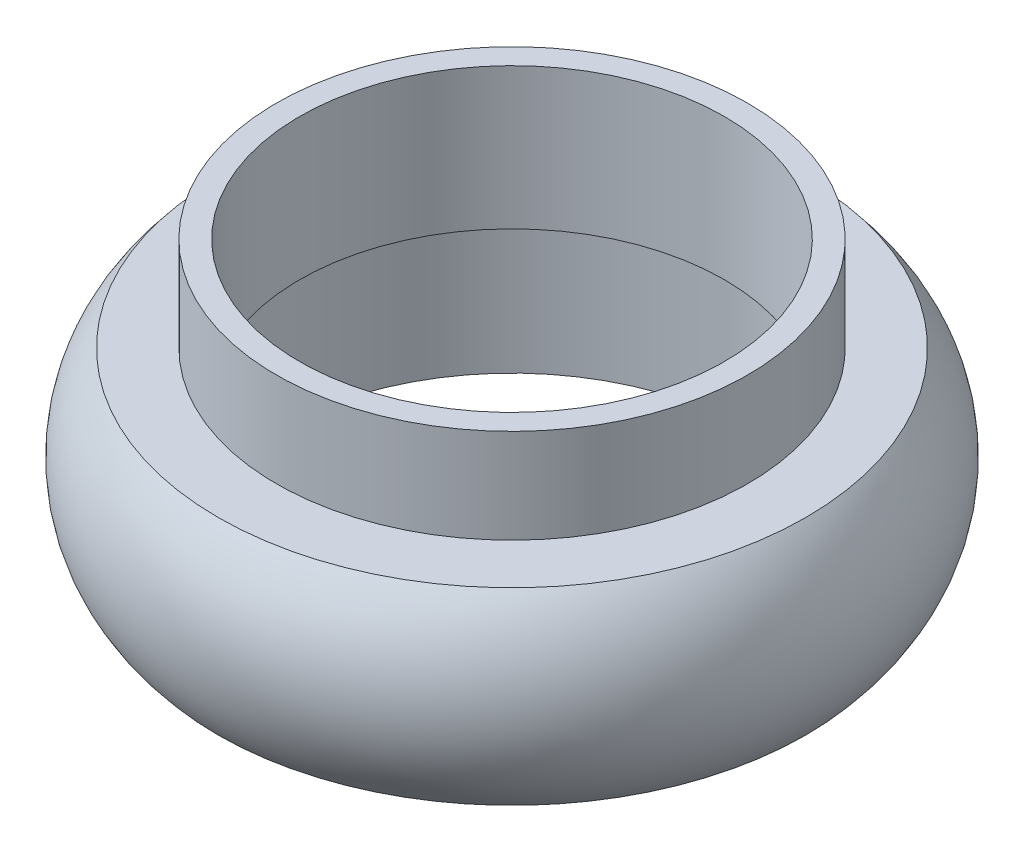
ISO-10303-21;
HEADER;
FILE_DESCRIPTION(('STEP AP214'),'2;1');
FILE_NAME('part.step','',(''),(''),'','','');
FILE_SCHEMA(('AUTOMOTIVE_DESIGN { 1 0 10303 214 1 1 1 1 }'));
ENDSEC;
DATA;
#1=APPLICATION_CONTEXT('core data for automotive mechanical design processes');
#2=APPLICATION_PROTOCOL_DEFINITION('international standard','automotive_design',2000,#1);
#3=PRODUCT_CONTEXT('',#1,'mechanical');
#4=PRODUCT('Part','Part','',(#3));
#5=PRODUCT_RELATED_PRODUCT_CATEGORY('part','',(#4));
#6=PRODUCT_DEFINITION_FORMATION('','',#4);
#7=PRODUCT_DEFINITION_CONTEXT('part definition',#1,'design');
#8=PRODUCT_DEFINITION('design','',#6,#7);
#9=PRODUCT_DEFINITION_SHAPE('','',#8);
#10=(LENGTH_UNIT() NAMED_UNIT(*) SI_UNIT(.MILLI.,.METRE.));
#11=(NAMED_UNIT(*) PLANE_ANGLE_UNIT() SI_UNIT($,.RADIAN.));
#12=(NAMED_UNIT(*) SI_UNIT($,.STERADIAN.) SOLID_ANGLE_UNIT());
#13=UNCERTAINTY_MEASURE_WITH_UNIT(LENGTH_MEASURE(1.E-05),#10,'distance_accuracy_value','');
#14=(GEOMETRIC_REPRESENTATION_CONTEXT(3) GLOBAL_UNCERTAINTY_ASSIGNED_CONTEXT((#13)) GLOBAL_UNIT_ASSIGNED_CONTEXT((#10,
#11,#12)) REPRESENTATION_CONTEXT('',''));
#15=CARTESIAN_POINT('',(0.,0.,0.));
#16=DIRECTION('',(0.,0.,1.));
#17=DIRECTION('',(1.,0.,0.));
#18=AXIS2_PLACEMENT_3D('',#15,#16,#17);
#19=CARTESIAN_POINT('',(14.3116282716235,19.05,0.));
#20=DIRECTION('',(0.,1.,0.));
#21=DIRECTION('',(0.,0.,1.));
#22=AXIS2_PLACEMENT_3D('',#19,#20,#21);
#23=PLANE('',#22);
#24=CARTESIAN_POINT('',(0.,19.05,0.));
#25=DIRECTION('',(0.,-1.,0.));
#26=DIRECTION('',(0.,0.,-1.));
#27=AXIS2_PLACEMENT_3D('',#24,#25,#26);
#28=CIRCLE('',#27,14.3116282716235);
#29=CARTESIAN_POINT('',(0.,19.05,-14.3116282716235));
#30=VERTEX_POINT('',#29);
#31=EDGE_CURVE('E10',#30,#30,#28,.T.);
#32=ORIENTED_EDGE('',*,*,#31,.T.);
#33=EDGE_LOOP('',(#32));
#34=FACE_BOUND('',#33,.T.);
#35=CARTESIAN_POINT('',(0.,19.05,0.));
#36=DIRECTION('',(0.,-1.,0.));
#37=DIRECTION('',(0.,0.,-1.));
#38=AXIS2_PLACEMENT_3D('',#35,#36,#37);
#39=CIRCLE('',#38,15.875);
#40=CARTESIAN_POINT('',(0.,19.05,-15.875));
#41=VERTEX_POINT('',#40);
#42=EDGE_CURVE('E58',#41,#41,#39,.T.);
#43=ORIENTED_EDGE('',*,*,#42,.F.);
#44=EDGE_LOOP('',(#43));
#45=FACE_BOUND('',#44,.T.);
#46=ADVANCED_FACE('F30',(#34,#45),#23,.T.);
#47=CARTESIAN_POINT('',(0.,0.,0.));
#48=DIRECTION('',(0.,-1.,0.));
#49=DIRECTION('',(0.,0.,-1.));
#50=AXIS2_PLACEMENT_3D('',#47,#48,#49);
#51=CYLINDRICAL_SURFACE('',#50,14.3116282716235);
#52=CARTESIAN_POINT('',(0.,9.525,0.));
#53=DIRECTION('',(0.,-1.,0.));
#54=DIRECTION('',(0.,0.,-1.));
#55=AXIS2_PLACEMENT_3D('',#52,#53,#54);
#56=CIRCLE('',#55,14.3116282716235);
#57=CARTESIAN_POINT('',(0.,9.525,-14.3116282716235));
#58=VERTEX_POINT('',#57);
#59=EDGE_CURVE('E36',#58,#58,#56,.T.);
#60=ORIENTED_EDGE('',*,*,#59,.T.);
#61=EDGE_LOOP('',(#60));
#62=FACE_BOUND('',#61,.T.);
#63=ORIENTED_EDGE('',*,*,#31,.F.);
#64=EDGE_LOOP('',(#63));
#65=FACE_BOUND('',#64,.T.);
#66=ADVANCED_FACE('F66',(#62,#65),#51,.F.);
#67=CARTESIAN_POINT('',(14.3116282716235,9.525,0.));
#68=DIRECTION('',(0.,-1.,0.));
#69=DIRECTION('',(0.,0.,-1.));
#70=AXIS2_PLACEMENT_3D('',#67,#68,#69);
#71=PLANE('',#70);
#72=CARTESIAN_POINT('',(0.,9.525,0.));
#73=DIRECTION('',(0.,-1.,0.));
#74=DIRECTION('',(0.,0.,-1.));
#75=AXIS2_PLACEMENT_3D('',#72,#73,#74);
#76=CIRCLE('',#75,15.875);
#77=CARTESIAN_POINT('',(0.,9.525,-15.875));
#78=VERTEX_POINT('',#77);
#79=EDGE_CURVE('E40',#78,#78,#76,.T.);
#80=ORIENTED_EDGE('',*,*,#79,.T.);
#81=EDGE_LOOP('',(#80));
#82=FACE_BOUND('',#81,.T.);
#83=ORIENTED_EDGE('',*,*,#59,.F.);
#84=EDGE_LOOP('',(#83));
#85=FACE_BOUND('',#84,.T.);
#86=ADVANCED_FACE('F70',(#82,#85),#71,.T.);
#87=CARTESIAN_POINT('',(0.,0.,0.));
#88=DIRECTION('',(0.,-1.,0.));
#89=DIRECTION('',(0.,0.,-1.));
#90=AXIS2_PLACEMENT_3D('',#87,#88,#89);
#91=CYLINDRICAL_SURFACE('',#90,15.875);
#92=CARTESIAN_POINT('',(0.,0.,0.));
#93=DIRECTION('',(0.,-1.,0.));
#94=DIRECTION('',(0.,0.,-1.));
#95=AXIS2_PLACEMENT_3D('',#92,#93,#94);
#96=CIRCLE('',#95,15.875);
#97=CARTESIAN_POINT('',(0.,0.,-15.875));
#98=VERTEX_POINT('',#97);
#99=EDGE_CURVE('E44',#98,#98,#96,.T.);
#100=ORIENTED_EDGE('',*,*,#99,.T.);
#101=EDGE_LOOP('',(#100));
#102=FACE_BOUND('',#101,.T.);
#103=ORIENTED_EDGE('',*,*,#79,.F.);
#104=EDGE_LOOP('',(#103));
#105=FACE_BOUND('',#104,.T.);
#106=ADVANCED_FACE('F74',(#102,#105),#91,.F.);
#107=CARTESIAN_POINT('',(15.875,0.,0.));
#108=DIRECTION('',(0.,-1.,0.));
#109=DIRECTION('',(0.,0.,-1.));
#110=AXIS2_PLACEMENT_3D('',#107,#108,#109);
#111=PLANE('',#110);
#112=CARTESIAN_POINT('',(0.,0.,0.));
#113=DIRECTION('',(0.,-1.,0.));
#114=DIRECTION('',(0.,0.,-1.));
#115=AXIS2_PLACEMENT_3D('',#112,#113,#114);
#116=CIRCLE('',#115,19.7995158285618);
#117=CARTESIAN_POINT('',(0.,0.,-19.7995158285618));
#118=VERTEX_POINT('',#117);
#119=EDGE_CURVE('E49',#118,#118,#116,.T.);
#120=ORIENTED_EDGE('',*,*,#119,.T.);
#121=EDGE_LOOP('',(#120));
#122=FACE_BOUND('',#121,.T.);
#123=ORIENTED_EDGE('',*,*,#99,.F.);
#124=EDGE_LOOP('',(#123));
#125=FACE_BOUND('',#124,.T.);
#126=ADVANCED_FACE('F81',(#122,#125),#111,.T.);
#127=CARTESIAN_POINT('',(0.,6.35,0.));
#128=DIRECTION('',(0.,-1.,0.));
#129=DIRECTION('',(0.,0.,-1.));
#130=AXIS2_PLACEMENT_3D('',#127,#128,#129);
#131=TOROIDAL_SURFACE('',#130,12.7,9.525);
#132=CARTESIAN_POINT('',(0.,12.7,0.));
#133=DIRECTION('',(0.,-1.,0.));
#134=DIRECTION('',(0.,0.,-1.));
#135=AXIS2_PLACEMENT_3D('',#132,#133,#134);
#136=CIRCLE('',#135,19.7995158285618);
#137=CARTESIAN_POINT('',(0.,12.7,-19.7995158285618));
#138=VERTEX_POINT('',#137);
#139=EDGE_CURVE('E52',#138,#138,#136,.T.);
#140=ORIENTED_EDGE('',*,*,#139,.T.);
#141=EDGE_LOOP('',(#140));
#142=FACE_BOUND('',#141,.T.);
#143=ORIENTED_EDGE('',*,*,#119,.F.);
#144=EDGE_LOOP('',(#143));
#145=FACE_BOUND('',#144,.T.);
#146=ADVANCED_FACE('F85',(#142,#145),#131,.T.);
#147=CARTESIAN_POINT('',(15.875,12.7,0.));
#148=DIRECTION('',(0.,1.,0.));
#149=DIRECTION('',(0.,0.,1.));
#150=AXIS2_PLACEMENT_3D('',#147,#148,#149);
#151=PLANE('',#150);
#152=CARTESIAN_POINT('',(0.,12.7,0.));
#153=DIRECTION('',(0.,-1.,0.));
#154=DIRECTION('',(0.,0.,-1.));
#155=AXIS2_PLACEMENT_3D('',#152,#153,#154);
#156=CIRCLE('',#155,15.875);
#157=CARTESIAN_POINT('',(0.,12.7,-15.875));
#158=VERTEX_POINT('',#157);
#159=EDGE_CURVE('E55',#158,#158,#156,.T.);
#160=ORIENTED_EDGE('',*,*,#159,.T.);
#161=EDGE_LOOP('',(#160));
#162=FACE_BOUND('',#161,.T.);
#163=ORIENTED_EDGE('',*,*,#139,.F.);
#164=EDGE_LOOP('',(#163));
#165=FACE_BOUND('',#164,.T.);
#166=ADVANCED_FACE('F89',(#162,#165),#151,.T.);
#167=CARTESIAN_POINT('',(0.,0.,0.));
#168=DIRECTION('',(0.,-1.,0.));
#169=DIRECTION('',(0.,0.,-1.));
#170=AXIS2_PLACEMENT_3D('',#167,#168,#169);
#171=CYLINDRICAL_SURFACE('',#170,15.875);
#172=ORIENTED_EDGE('',*,*,#42,.T.);
#173=EDGE_LOOP('',(#172));
#174=FACE_BOUND('',#173,.T.);
#175=ORIENTED_EDGE('',*,*,#159,.F.);
#176=EDGE_LOOP('',(#175));
#177=FACE_BOUND('',#176,.T.);
#178=ADVANCED_FACE('F62',(#174,#177),#171,.T.);
#179=CLOSED_SHELL('',(#46,#66,#86,#106,#126,#146,#166,#178));
#180=MANIFOLD_SOLID_BREP('B2',#179);
#181=ADVANCED_BREP_SHAPE_REPRESENTATION('',(#18,#180),#14);
#182=SHAPE_DEFINITION_REPRESENTATION(#9,#181);
ENDSEC;
END-ISO-10303-21;
